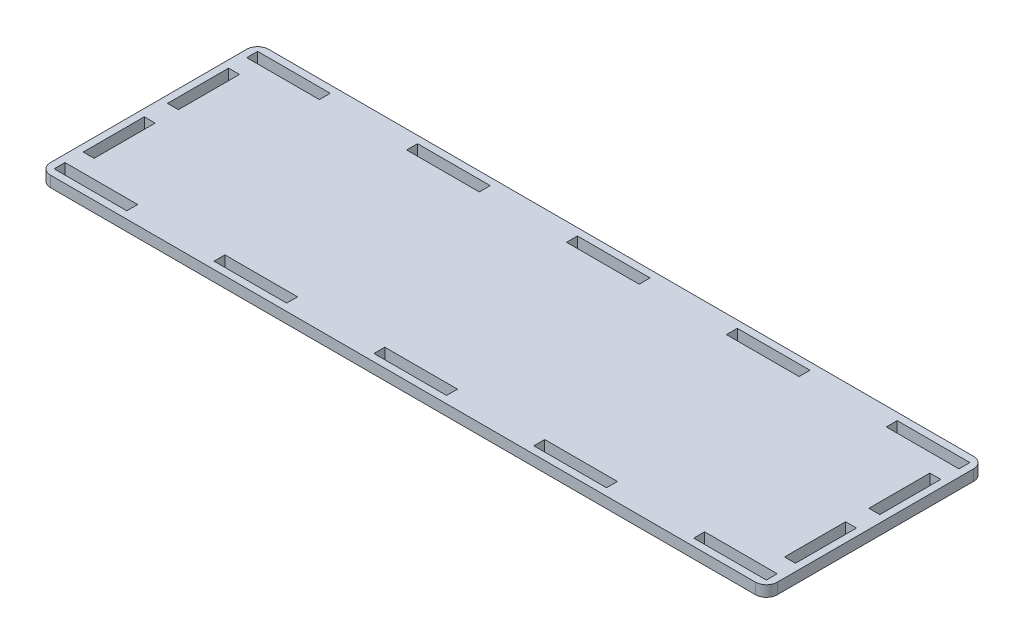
from build123d import *

# Parameters (mm, degrees)
SKETCH_1_W      = 20
SKETCH_1_H      = 3
SKETCH_1_W_2    = 3
SKETCH_1_H_2    = 16.802266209
EXTRUDE_1_DEPTH = 3


with BuildPart() as part:
    # Sketch 1 → Extrude 1 (new body)
    with BuildSketch(Plane(origin=(0, 0, 0), x_dir=(1, 0, 0), z_dir=(0, 1, 0))):
        with BuildLine():
            Line((3, 0), (197, 0))
            ThreePointArc((197, 0), (199.121320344, -0.878679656), (200, -3))
            Line((200, -3), (200, -57))
            ThreePointArc((200, -57), (199.121320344, -59.121320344), (197, -60))
            Line((197, -60), (3, -60))
            ThreePointArc((3, -60), (0.878679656, -59.121320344), (0, -57))
            Line((0, -57), (0, -3))
            ThreePointArc((0, -3), (0.878679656, -0.878679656), (3, 0))
        make_face()
        with Locations((56, -3.5)):
            Rectangle(SKETCH_1_W, SKETCH_1_H, mode=Mode.SUBTRACT)
        with Locations((12, -3.5)):
            Rectangle(SKETCH_1_W, SKETCH_1_H, mode=Mode.SUBTRACT)
        with Locations((100, -3.5)):
            Rectangle(SKETCH_1_W, SKETCH_1_H, mode=Mode.SUBTRACT)
        with Locations((144, -3.5)):
            Rectangle(SKETCH_1_W, SKETCH_1_H, mode=Mode.SUBTRACT)
        with Locations((188, -3.5)):
            Rectangle(SKETCH_1_W, SKETCH_1_H, mode=Mode.SUBTRACT)
        with Locations((56, -56.5)):
            Rectangle(SKETCH_1_W, SKETCH_1_H, mode=Mode.SUBTRACT)
        with Locations((100, -56.5)):
            Rectangle(SKETCH_1_W, SKETCH_1_H, mode=Mode.SUBTRACT)
        with Locations((144, -56.5)):
            Rectangle(SKETCH_1_W, SKETCH_1_H, mode=Mode.SUBTRACT)
        with Locations((188, -56.5)):
            Rectangle(SKETCH_1_W, SKETCH_1_H, mode=Mode.SUBTRACT)
        with Locations((12, -56.5)):
            Rectangle(SKETCH_1_W, SKETCH_1_H, mode=Mode.SUBTRACT)
        with Locations((3.5, -18.401133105)):
            Rectangle(SKETCH_1_W_2, SKETCH_1_H_2, mode=Mode.SUBTRACT)
        with Locations((196.5, -18.401133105)):
            Rectangle(SKETCH_1_W_2, SKETCH_1_H_2, mode=Mode.SUBTRACT)
        with Locations((3.5, -41.598866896)):
            Rectangle(SKETCH_1_W_2, SKETCH_1_H_2, mode=Mode.SUBTRACT)
        with Locations((196.5, -41.598866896)):
            Rectangle(SKETCH_1_W_2, SKETCH_1_H_2, mode=Mode.SUBTRACT)
    extrude(amount=EXTRUDE_1_DEPTH)


solid = part.part
